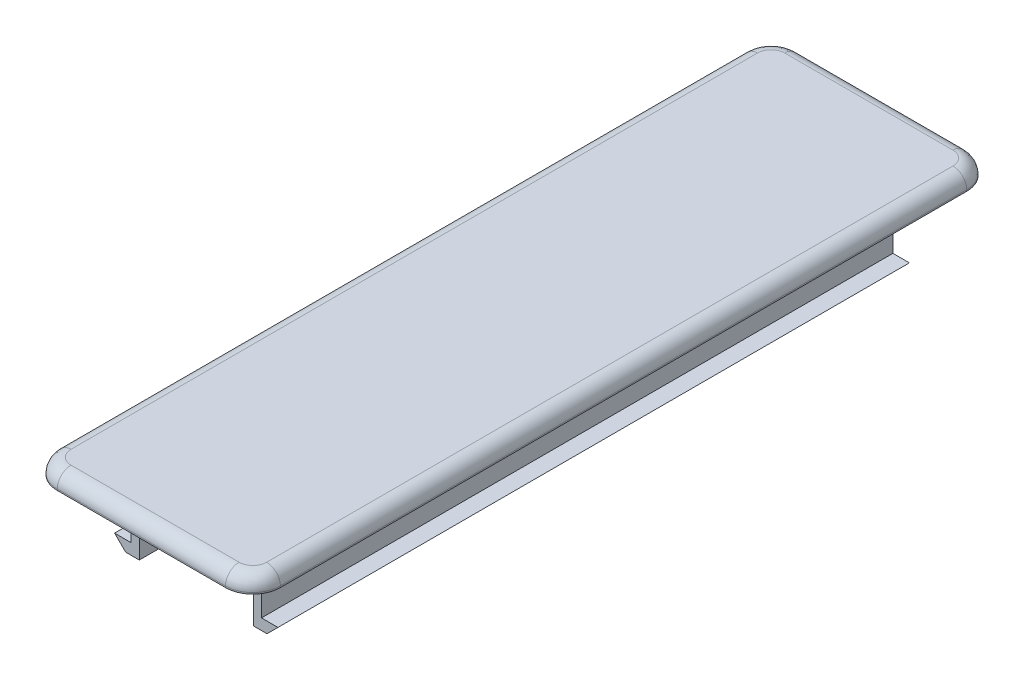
ISO-10303-21;
HEADER;
FILE_DESCRIPTION(('STEP AP214'),'2;1');
FILE_NAME('part.step','',(''),(''),'','','');
FILE_SCHEMA(('AUTOMOTIVE_DESIGN { 1 0 10303 214 1 1 1 1 }'));
ENDSEC;
DATA;
#1=APPLICATION_CONTEXT('core data for automotive mechanical design processes');
#2=APPLICATION_PROTOCOL_DEFINITION('international standard','automotive_design',2000,#1);
#3=PRODUCT_CONTEXT('',#1,'mechanical');
#4=PRODUCT('Part','Part','',(#3));
#5=PRODUCT_RELATED_PRODUCT_CATEGORY('part','',(#4));
#6=PRODUCT_DEFINITION_FORMATION('','',#4);
#7=PRODUCT_DEFINITION_CONTEXT('part definition',#1,'design');
#8=PRODUCT_DEFINITION('design','',#6,#7);
#9=PRODUCT_DEFINITION_SHAPE('','',#8);
#10=(LENGTH_UNIT() NAMED_UNIT(*) SI_UNIT(.MILLI.,.METRE.));
#11=(NAMED_UNIT(*) PLANE_ANGLE_UNIT() SI_UNIT($,.RADIAN.));
#12=(NAMED_UNIT(*) SI_UNIT($,.STERADIAN.) SOLID_ANGLE_UNIT());
#13=UNCERTAINTY_MEASURE_WITH_UNIT(LENGTH_MEASURE(1.E-05),#10,'distance_accuracy_value','');
#14=(GEOMETRIC_REPRESENTATION_CONTEXT(3) GLOBAL_UNCERTAINTY_ASSIGNED_CONTEXT((#13)) GLOBAL_UNIT_ASSIGNED_CONTEXT((#10,
#11,#12)) REPRESENTATION_CONTEXT('',''));
#15=CARTESIAN_POINT('',(0.,0.,0.));
#16=DIRECTION('',(0.,0.,1.));
#17=DIRECTION('',(1.,0.,0.));
#18=AXIS2_PLACEMENT_3D('',#15,#16,#17);
#19=CARTESIAN_POINT('',(-8.125,1.1,0.));
#20=DIRECTION('',(0.,1.,0.));
#21=DIRECTION('',(0.,0.,1.));
#22=AXIS2_PLACEMENT_3D('',#19,#20,#21);
#23=PLANE('',#22);
#24=DIRECTION('',(0.,0.,-1.));
#25=VECTOR('',#24,1.);
#26=CARTESIAN_POINT('',(7.125,1.1,0.));
#27=LINE('',#26,#25);
#28=CARTESIAN_POINT('',(7.125,1.1,-25.));
#29=VERTEX_POINT('',#28);
#30=CARTESIAN_POINT('',(7.125,1.1,25.));
#31=VERTEX_POINT('',#30);
#32=EDGE_CURVE('E428',#29,#31,#27,.F.);
#33=ORIENTED_EDGE('',*,*,#32,.F.);
#34=CARTESIAN_POINT('',(6.125,1.1,-25.));
#35=DIRECTION('',(0.,-1.,0.));
#36=DIRECTION('',(0.,0.,-1.));
#37=AXIS2_PLACEMENT_3D('',#34,#35,#36);
#38=CIRCLE('',#37,1.);
#39=CARTESIAN_POINT('',(6.125,1.1,-26.));
#40=VERTEX_POINT('',#39);
#41=EDGE_CURVE('E440',#40,#29,#38,.T.);
#42=ORIENTED_EDGE('',*,*,#41,.F.);
#43=DIRECTION('',(-1.,0.,0.));
#44=VECTOR('',#43,1.);
#45=CARTESIAN_POINT('',(-4.0625,1.1,-26.));
#46=LINE('',#45,#44);
#47=CARTESIAN_POINT('',(-6.125,1.1,-26.));
#48=VERTEX_POINT('',#47);
#49=EDGE_CURVE('E205',#48,#40,#46,.F.);
#50=ORIENTED_EDGE('',*,*,#49,.F.);
#51=CARTESIAN_POINT('',(-6.125,1.1,-25.));
#52=DIRECTION('',(0.,-1.,0.));
#53=DIRECTION('',(-1.,0.,0.));
#54=AXIS2_PLACEMENT_3D('',#51,#52,#53);
#55=CIRCLE('',#54,1.);
#56=CARTESIAN_POINT('',(-7.125,1.1,-25.));
#57=VERTEX_POINT('',#56);
#58=EDGE_CURVE('E327',#57,#48,#55,.T.);
#59=ORIENTED_EDGE('',*,*,#58,.F.);
#60=DIRECTION('',(0.,0.,-1.));
#61=VECTOR('',#60,1.);
#62=CARTESIAN_POINT('',(-7.125,1.1,0.));
#63=LINE('',#62,#61);
#64=CARTESIAN_POINT('',(-7.125,1.1,25.));
#65=VERTEX_POINT('',#64);
#66=EDGE_CURVE('E361',#65,#57,#63,.T.);
#67=ORIENTED_EDGE('',*,*,#66,.F.);
#68=CARTESIAN_POINT('',(-6.125,1.1,25.));
#69=DIRECTION('',(0.,-1.,0.));
#70=DIRECTION('',(0.,0.,1.));
#71=AXIS2_PLACEMENT_3D('',#68,#69,#70);
#72=CIRCLE('',#71,1.);
#73=CARTESIAN_POINT('',(-6.125,1.1,26.));
#74=VERTEX_POINT('',#73);
#75=EDGE_CURVE('E375',#74,#65,#72,.T.);
#76=ORIENTED_EDGE('',*,*,#75,.F.);
#77=DIRECTION('',(1.,0.,0.));
#78=VECTOR('',#77,1.);
#79=CARTESIAN_POINT('',(-4.0625,1.1,26.));
#80=LINE('',#79,#78);
#81=CARTESIAN_POINT('',(6.125,1.1,26.));
#82=VERTEX_POINT('',#81);
#83=EDGE_CURVE('E380',#82,#74,#80,.F.);
#84=ORIENTED_EDGE('',*,*,#83,.F.);
#85=CARTESIAN_POINT('',(6.125,1.1,25.));
#86=DIRECTION('',(0.,-1.,0.));
#87=DIRECTION('',(1.,0.,0.));
#88=AXIS2_PLACEMENT_3D('',#85,#86,#87);
#89=CIRCLE('',#88,1.);
#90=EDGE_CURVE('E407',#31,#82,#89,.T.);
#91=ORIENTED_EDGE('',*,*,#90,.F.);
#92=EDGE_LOOP('',(#33,#42,#50,#59,#67,#76,#84,#91));
#93=FACE_BOUND('',#92,.T.);
#94=ADVANCED_FACE('F15',(#93),#23,.T.);
#95=CARTESIAN_POINT('',(-5.15,-5.4,0.));
#96=DIRECTION('',(-0.707106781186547,-0.707106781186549,0.));
#97=DIRECTION('',(0.707106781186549,-0.707106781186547,0.));
#98=AXIS2_PLACEMENT_3D('',#95,#96,#97);
#99=PLANE('',#98);
#100=DIRECTION('',(0.707106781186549,-0.707106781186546,0.));
#101=VECTOR('',#100,1.);
#102=CARTESIAN_POINT('',(-5.95,-4.6,23.));
#103=LINE('',#102,#101);
#104=CARTESIAN_POINT('',(-5.95,-4.6,23.));
#105=VERTEX_POINT('',#104);
#106=CARTESIAN_POINT('',(-5.15,-5.4,23.));
#107=VERTEX_POINT('',#106);
#108=EDGE_CURVE('E194',#105,#107,#103,.T.);
#109=ORIENTED_EDGE('',*,*,#108,.F.);
#110=DIRECTION('',(0.,0.,1.));
#111=VECTOR('',#110,1.);
#112=CARTESIAN_POINT('',(-5.95,-4.6,0.));
#113=LINE('',#112,#111);
#114=CARTESIAN_POINT('',(-5.95,-4.6,-23.));
#115=VERTEX_POINT('',#114);
#116=EDGE_CURVE('E180',#115,#105,#113,.T.);
#117=ORIENTED_EDGE('',*,*,#116,.F.);
#118=DIRECTION('',(-0.707106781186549,0.707106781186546,0.));
#119=VECTOR('',#118,1.);
#120=CARTESIAN_POINT('',(-5.15,-5.4,-23.));
#121=LINE('',#120,#119);
#122=CARTESIAN_POINT('',(-5.15,-5.4,-23.));
#123=VERTEX_POINT('',#122);
#124=EDGE_CURVE('E19',#123,#115,#121,.T.);
#125=ORIENTED_EDGE('',*,*,#124,.F.);
#126=DIRECTION('',(0.,0.,-1.));
#127=VECTOR('',#126,1.);
#128=CARTESIAN_POINT('',(-5.15,-5.4,0.));
#129=LINE('',#128,#127);
#130=EDGE_CURVE('E178',#107,#123,#129,.T.);
#131=ORIENTED_EDGE('',*,*,#130,.F.);
#132=EDGE_LOOP('',(#109,#117,#125,#131));
#133=FACE_BOUND('',#132,.T.);
#134=ADVANCED_FACE('F176',(#133),#99,.T.);
#135=CARTESIAN_POINT('',(5.95,-4.6,0.));
#136=DIRECTION('',(0.707106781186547,-0.707106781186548,0.));
#137=DIRECTION('',(0.707106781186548,0.707106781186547,0.));
#138=AXIS2_PLACEMENT_3D('',#135,#136,#137);
#139=PLANE('',#138);
#140=DIRECTION('',(0.707106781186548,0.707106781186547,0.));
#141=VECTOR('',#140,1.);
#142=CARTESIAN_POINT('',(5.15,-5.4,23.));
#143=LINE('',#142,#141);
#144=CARTESIAN_POINT('',(5.15,-5.4,23.));
#145=VERTEX_POINT('',#144);
#146=CARTESIAN_POINT('',(5.95,-4.6,23.));
#147=VERTEX_POINT('',#146);
#148=EDGE_CURVE('E212',#145,#147,#143,.T.);
#149=ORIENTED_EDGE('',*,*,#148,.F.);
#150=DIRECTION('',(0.,0.,-1.));
#151=VECTOR('',#150,1.);
#152=CARTESIAN_POINT('',(5.15,-5.4,0.));
#153=LINE('',#152,#151);
#154=CARTESIAN_POINT('',(5.15,-5.4,-23.));
#155=VERTEX_POINT('',#154);
#156=EDGE_CURVE('E197',#155,#145,#153,.F.);
#157=ORIENTED_EDGE('',*,*,#156,.F.);
#158=DIRECTION('',(-0.707106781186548,-0.707106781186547,0.));
#159=VECTOR('',#158,1.);
#160=CARTESIAN_POINT('',(5.95,-4.6,-23.));
#161=LINE('',#160,#159);
#162=CARTESIAN_POINT('',(5.95,-4.6,-23.));
#163=VERTEX_POINT('',#162);
#164=EDGE_CURVE('E199',#163,#155,#161,.T.);
#165=ORIENTED_EDGE('',*,*,#164,.F.);
#166=DIRECTION('',(0.,0.,1.));
#167=VECTOR('',#166,1.);
#168=CARTESIAN_POINT('',(5.95,-4.6,0.));
#169=LINE('',#168,#167);
#170=EDGE_CURVE('E213',#147,#163,#169,.F.);
#171=ORIENTED_EDGE('',*,*,#170,.F.);
#172=EDGE_LOOP('',(#149,#157,#165,#171));
#173=FACE_BOUND('',#172,.T.);
#174=ADVANCED_FACE('F245',(#173),#139,.T.);
#175=CARTESIAN_POINT('',(6.125,0.1,-26.));
#176=DIRECTION('',(1.,0.,0.));
#177=DIRECTION('',(0.,0.,-1.));
#178=AXIS2_PLACEMENT_3D('',#175,#176,#177);
#179=CIRCLE('',#178,1.);
#180=TRIMMED_CURVE('',#179,(PARAMETER_VALUE(-3.14159265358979)),
(PARAMETER_VALUE(3.14159265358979)),.T.,.PARAMETER.);
#181=CARTESIAN_POINT('',(6.125,0.1,-25.));
#182=DIRECTION('',(0.,-1.,0.));
#183=AXIS1_PLACEMENT('',#181,#182);
#184=SURFACE_OF_REVOLUTION('',#180,#183);
#185=CARTESIAN_POINT('',(6.125,0.100000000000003,-26.));
#186=DIRECTION('',(-1.,0.,0.));
#187=DIRECTION('',(0.,-1.,0.));
#188=AXIS2_PLACEMENT_3D('',#185,#186,#187);
#189=CIRCLE('',#188,1.);
#190=CARTESIAN_POINT('',(6.125,0.100000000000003,-27.));
#191=VERTEX_POINT('',#190);
#192=EDGE_CURVE('E323',#40,#191,#189,.T.);
#193=ORIENTED_EDGE('',*,*,#192,.F.);
#194=ORIENTED_EDGE('',*,*,#41,.T.);
#195=CARTESIAN_POINT('',(7.125,0.100000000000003,-25.));
#196=DIRECTION('',(0.,0.,-1.));
#197=DIRECTION('',(-1.,0.,0.));
#198=AXIS2_PLACEMENT_3D('',#195,#196,#197);
#199=CIRCLE('',#198,1.);
#200=CARTESIAN_POINT('',(8.125,0.100000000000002,-25.));
#201=VERTEX_POINT('',#200);
#202=EDGE_CURVE('E435',#201,#29,#199,.F.);
#203=ORIENTED_EDGE('',*,*,#202,.F.);
#204=CARTESIAN_POINT('',(6.125,0.100000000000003,-25.));
#205=DIRECTION('',(0.,1.,0.));
#206=DIRECTION('',(0.,0.,1.));
#207=AXIS2_PLACEMENT_3D('',#204,#205,#206);
#208=CIRCLE('',#207,2.);
#209=EDGE_CURVE('E215',#191,#201,#208,.F.);
#210=ORIENTED_EDGE('',*,*,#209,.F.);
#211=EDGE_LOOP('',(#193,#194,#203,#210));
#212=FACE_BOUND('',#211,.T.);
#213=ADVANCED_FACE('F444',(#212),#184,.F.);
#214=CARTESIAN_POINT('',(7.125,0.100000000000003,0.));
#215=DIRECTION('',(0.,0.,-1.));
#216=DIRECTION('',(-1.,0.,0.));
#217=AXIS2_PLACEMENT_3D('',#214,#215,#216);
#218=CYLINDRICAL_SURFACE('',#217,1.);
#219=ORIENTED_EDGE('',*,*,#202,.T.);
#220=ORIENTED_EDGE('',*,*,#32,.T.);
#221=CARTESIAN_POINT('',(7.125,0.1,25.));
#222=DIRECTION('',(0.,0.,1.));
#223=DIRECTION('',(1.,0.,0.));
#224=AXIS2_PLACEMENT_3D('',#221,#222,#223);
#225=CIRCLE('',#224,1.);
#226=CARTESIAN_POINT('',(8.125,0.100000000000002,25.));
#227=VERTEX_POINT('',#226);
#228=EDGE_CURVE('E414',#227,#31,#225,.T.);
#229=ORIENTED_EDGE('',*,*,#228,.F.);
#230=DIRECTION('',(0.,0.,-1.));
#231=VECTOR('',#230,1.);
#232=CARTESIAN_POINT('',(8.125,0.1,0.));
#233=LINE('',#232,#231);
#234=EDGE_CURVE('E309',#201,#227,#233,.F.);
#235=ORIENTED_EDGE('',*,*,#234,.F.);
#236=EDGE_LOOP('',(#219,#220,#229,#235));
#237=FACE_BOUND('',#236,.T.);
#238=ADVANCED_FACE('F420',(#237),#218,.T.);
#239=CARTESIAN_POINT('',(6.125,0.1,24.));
#240=DIRECTION('',(1.,0.,0.));
#241=DIRECTION('',(0.,0.,-1.));
#242=AXIS2_PLACEMENT_3D('',#239,#240,#241);
#243=CIRCLE('',#242,1.);
#244=TRIMMED_CURVE('',#243,(PARAMETER_VALUE(-3.14159265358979)),
(PARAMETER_VALUE(3.14159265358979)),.T.,.PARAMETER.);
#245=CARTESIAN_POINT('',(6.125,0.1,25.));
#246=DIRECTION('',(0.,-1.,0.));
#247=AXIS1_PLACEMENT('',#245,#246);
#248=SURFACE_OF_REVOLUTION('',#244,#247);
#249=ORIENTED_EDGE('',*,*,#228,.T.);
#250=ORIENTED_EDGE('',*,*,#90,.T.);
#251=CARTESIAN_POINT('',(6.125,0.100000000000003,26.));
#252=DIRECTION('',(1.,0.,0.));
#253=DIRECTION('',(0.,1.,0.));
#254=AXIS2_PLACEMENT_3D('',#251,#252,#253);
#255=CIRCLE('',#254,1.);
#256=CARTESIAN_POINT('',(6.125,0.100000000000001,27.));
#257=VERTEX_POINT('',#256);
#258=EDGE_CURVE('E404',#257,#82,#255,.F.);
#259=ORIENTED_EDGE('',*,*,#258,.F.);
#260=CARTESIAN_POINT('',(6.125,0.100000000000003,25.));
#261=DIRECTION('',(0.,-1.,0.));
#262=DIRECTION('',(0.,0.,-1.));
#263=AXIS2_PLACEMENT_3D('',#260,#261,#262);
#264=CIRCLE('',#263,2.);
#265=EDGE_CURVE('E305',#227,#257,#264,.T.);
#266=ORIENTED_EDGE('',*,*,#265,.F.);
#267=EDGE_LOOP('',(#249,#250,#259,#266));
#268=FACE_BOUND('',#267,.T.);
#269=ADVANCED_FACE('F416',(#268),#248,.F.);
#270=CARTESIAN_POINT('',(-4.0625,0.100000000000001,26.));
#271=DIRECTION('',(1.,0.,0.));
#272=DIRECTION('',(0.,1.,0.));
#273=AXIS2_PLACEMENT_3D('',#270,#271,#272);
#274=CYLINDRICAL_SURFACE('',#273,1.);
#275=CARTESIAN_POINT('',(-6.125,0.1,26.));
#276=DIRECTION('',(-1.,0.,0.));
#277=DIRECTION('',(0.,0.,1.));
#278=AXIS2_PLACEMENT_3D('',#275,#276,#277);
#279=CIRCLE('',#278,1.);
#280=CARTESIAN_POINT('',(-6.125,0.1,27.));
#281=VERTEX_POINT('',#280);
#282=EDGE_CURVE('E398',#281,#74,#279,.T.);
#283=ORIENTED_EDGE('',*,*,#282,.F.);
#284=DIRECTION('',(1.,0.,0.));
#285=VECTOR('',#284,1.);
#286=CARTESIAN_POINT('',(0.,0.1,27.));
#287=LINE('',#286,#285);
#288=EDGE_CURVE('E301',#257,#281,#287,.F.);
#289=ORIENTED_EDGE('',*,*,#288,.F.);
#290=ORIENTED_EDGE('',*,*,#258,.T.);
#291=ORIENTED_EDGE('',*,*,#83,.T.);
#292=EDGE_LOOP('',(#283,#289,#290,#291));
#293=FACE_BOUND('',#292,.T.);
#294=ADVANCED_FACE('F392',(#293),#274,.T.);
#295=CARTESIAN_POINT('',(-6.125,0.1,24.));
#296=DIRECTION('',(1.,0.,0.));
#297=DIRECTION('',(0.,0.,-1.));
#298=AXIS2_PLACEMENT_3D('',#295,#296,#297);
#299=CIRCLE('',#298,1.);
#300=TRIMMED_CURVE('',#299,(PARAMETER_VALUE(-3.14159265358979)),
(PARAMETER_VALUE(3.14159265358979)),.T.,.PARAMETER.);
#301=CARTESIAN_POINT('',(-6.125,0.1,25.));
#302=DIRECTION('',(0.,-1.,0.));
#303=AXIS1_PLACEMENT('',#301,#302);
#304=SURFACE_OF_REVOLUTION('',#300,#303);
#305=CARTESIAN_POINT('',(-7.125,0.1,25.));
#306=DIRECTION('',(0.,0.,-1.));
#307=DIRECTION('',(-1.,0.,0.));
#308=AXIS2_PLACEMENT_3D('',#305,#306,#307);
#309=CIRCLE('',#308,1.);
#310=CARTESIAN_POINT('',(-8.125,0.1,25.));
#311=VERTEX_POINT('',#310);
#312=EDGE_CURVE('E368',#311,#65,#309,.T.);
#313=ORIENTED_EDGE('',*,*,#312,.F.);
#314=CARTESIAN_POINT('',(-6.125,0.1,25.));
#315=DIRECTION('',(0.,1.,0.));
#316=DIRECTION('',(0.,0.,1.));
#317=AXIS2_PLACEMENT_3D('',#314,#315,#316);
#318=CIRCLE('',#317,2.);
#319=EDGE_CURVE('E297',#281,#311,#318,.F.);
#320=ORIENTED_EDGE('',*,*,#319,.F.);
#321=ORIENTED_EDGE('',*,*,#282,.T.);
#322=ORIENTED_EDGE('',*,*,#75,.T.);
#323=EDGE_LOOP('',(#313,#320,#321,#322));
#324=FACE_BOUND('',#323,.T.);
#325=ADVANCED_FACE('F382',(#324),#304,.F.);
#326=CARTESIAN_POINT('',(-7.125,0.1,0.));
#327=DIRECTION('',(0.,0.,-1.));
#328=DIRECTION('',(-1.,0.,0.));
#329=AXIS2_PLACEMENT_3D('',#326,#327,#328);
#330=CYLINDRICAL_SURFACE('',#329,1.);
#331=CARTESIAN_POINT('',(-7.125,0.0999999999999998,-25.));
#332=DIRECTION('',(0.,0.,-1.));
#333=DIRECTION('',(-1.,0.,0.));
#334=AXIS2_PLACEMENT_3D('',#331,#332,#333);
#335=CIRCLE('',#334,1.);
#336=CARTESIAN_POINT('',(-8.125,0.1,-25.));
#337=VERTEX_POINT('',#336);
#338=EDGE_CURVE('E342',#337,#57,#335,.T.);
#339=ORIENTED_EDGE('',*,*,#338,.F.);
#340=DIRECTION('',(0.,0.,1.));
#341=VECTOR('',#340,1.);
#342=CARTESIAN_POINT('',(-8.125,0.1,0.));
#343=LINE('',#342,#341);
#344=EDGE_CURVE('E293',#311,#337,#343,.F.);
#345=ORIENTED_EDGE('',*,*,#344,.F.);
#346=ORIENTED_EDGE('',*,*,#312,.T.);
#347=ORIENTED_EDGE('',*,*,#66,.T.);
#348=EDGE_LOOP('',(#339,#345,#346,#347));
#349=FACE_BOUND('',#348,.T.);
#350=ADVANCED_FACE('F351',(#349),#330,.T.);
#351=CARTESIAN_POINT('',(-6.125,0.1,-26.));
#352=DIRECTION('',(1.,0.,0.));
#353=DIRECTION('',(0.,0.,-1.));
#354=AXIS2_PLACEMENT_3D('',#351,#352,#353);
#355=CIRCLE('',#354,1.);
#356=TRIMMED_CURVE('',#355,(PARAMETER_VALUE(-3.14159265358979)),
(PARAMETER_VALUE(3.14159265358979)),.T.,.PARAMETER.);
#357=CARTESIAN_POINT('',(-6.125,0.1,-25.));
#358=DIRECTION('',(0.,-1.,0.));
#359=AXIS1_PLACEMENT('',#357,#358);
#360=SURFACE_OF_REVOLUTION('',#356,#359);
#361=CARTESIAN_POINT('',(-6.125,0.100000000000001,-26.));
#362=DIRECTION('',(-1.,0.,0.));
#363=DIRECTION('',(0.,-1.,0.));
#364=AXIS2_PLACEMENT_3D('',#361,#362,#363);
#365=CIRCLE('',#364,1.);
#366=CARTESIAN_POINT('',(-6.125,0.100000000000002,-27.));
#367=VERTEX_POINT('',#366);
#368=EDGE_CURVE('E326',#367,#48,#365,.F.);
#369=ORIENTED_EDGE('',*,*,#368,.F.);
#370=CARTESIAN_POINT('',(-6.125,0.1,-25.));
#371=DIRECTION('',(0.,-1.,0.));
#372=DIRECTION('',(0.,0.,-1.));
#373=AXIS2_PLACEMENT_3D('',#370,#371,#372);
#374=CIRCLE('',#373,2.);
#375=EDGE_CURVE('E289',#337,#367,#374,.T.);
#376=ORIENTED_EDGE('',*,*,#375,.F.);
#377=ORIENTED_EDGE('',*,*,#338,.T.);
#378=ORIENTED_EDGE('',*,*,#58,.T.);
#379=EDGE_LOOP('',(#369,#376,#377,#378));
#380=FACE_BOUND('',#379,.T.);
#381=ADVANCED_FACE('F345',(#380),#360,.F.);
#382=CARTESIAN_POINT('',(-4.0625,0.100000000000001,-26.));
#383=DIRECTION('',(-1.,0.,0.));
#384=DIRECTION('',(0.,-1.,0.));
#385=AXIS2_PLACEMENT_3D('',#382,#383,#384);
#386=CYLINDRICAL_SURFACE('',#385,1.);
#387=ORIENTED_EDGE('',*,*,#368,.T.);
#388=ORIENTED_EDGE('',*,*,#49,.T.);
#389=ORIENTED_EDGE('',*,*,#192,.T.);
#390=DIRECTION('',(1.,0.,0.));
#391=VECTOR('',#390,1.);
#392=CARTESIAN_POINT('',(0.,0.100000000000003,-27.));
#393=LINE('',#392,#391);
#394=EDGE_CURVE('E280',#191,#367,#393,.F.);
#395=ORIENTED_EDGE('',*,*,#394,.T.);
#396=EDGE_LOOP('',(#387,#388,#389,#395));
#397=FACE_BOUND('',#396,.T.);
#398=ADVANCED_FACE('F350',(#397),#386,.T.);
#399=CARTESIAN_POINT('',(-5.95,-4.6,0.));
#400=DIRECTION('',(0.,1.,0.));
#401=DIRECTION('',(0.,0.,1.));
#402=AXIS2_PLACEMENT_3D('',#399,#400,#401);
#403=PLANE('',#402);
#404=DIRECTION('',(1.,0.,0.));
#405=VECTOR('',#404,1.);
#406=CARTESIAN_POINT('',(1.40627206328,-4.6,23.));
#407=LINE('',#406,#405);
#408=CARTESIAN_POINT('',(-4.75,-4.6,23.));
#409=VERTEX_POINT('',#408);
#410=EDGE_CURVE('E316',#409,#105,#407,.F.);
#411=ORIENTED_EDGE('',*,*,#410,.F.);
#412=DIRECTION('',(0.,0.,1.));
#413=VECTOR('',#412,1.);
#414=CARTESIAN_POINT('',(-4.75,-4.6,0.));
#415=LINE('',#414,#413);
#416=CARTESIAN_POINT('',(-4.75,-4.6,-23.));
#417=VERTEX_POINT('',#416);
#418=EDGE_CURVE('E274',#417,#409,#415,.T.);
#419=ORIENTED_EDGE('',*,*,#418,.F.);
#420=DIRECTION('',(1.,0.,0.));
#421=VECTOR('',#420,1.);
#422=CARTESIAN_POINT('',(-5.05,-4.6,-23.));
#423=LINE('',#422,#421);
#424=EDGE_CURVE('E183',#115,#417,#423,.T.);
#425=ORIENTED_EDGE('',*,*,#424,.F.);
#426=ORIENTED_EDGE('',*,*,#116,.T.);
#427=EDGE_LOOP('',(#411,#419,#425,#426));
#428=FACE_BOUND('',#427,.T.);
#429=ADVANCED_FACE('F587',(#428),#403,.T.);
#430=CARTESIAN_POINT('',(-5.95,0.,-23.));
#431=DIRECTION('',(0.,0.,-1.));
#432=DIRECTION('',(1.,0.,0.));
#433=AXIS2_PLACEMENT_3D('',#430,#431,#432);
#434=PLANE('',#433);
#435=ORIENTED_EDGE('',*,*,#124,.T.);
#436=ORIENTED_EDGE('',*,*,#424,.T.);
#437=DIRECTION('',(0.,1.,0.));
#438=VECTOR('',#437,1.);
#439=CARTESIAN_POINT('',(-4.75,-4.6,-23.));
#440=LINE('',#439,#438);
#441=CARTESIAN_POINT('',(-4.75,0.,-23.));
#442=VERTEX_POINT('',#441);
#443=EDGE_CURVE('E277',#442,#417,#440,.F.);
#444=ORIENTED_EDGE('',*,*,#443,.F.);
#445=DIRECTION('',(1.,0.,0.));
#446=VECTOR('',#445,1.);
#447=CARTESIAN_POINT('',(-5.05,0.,-23.));
#448=LINE('',#447,#446);
#449=CARTESIAN_POINT('',(-4.15,0.,-23.));
#450=VERTEX_POINT('',#449);
#451=EDGE_CURVE('E184',#442,#450,#448,.T.);
#452=ORIENTED_EDGE('',*,*,#451,.T.);
#453=DIRECTION('',(0.,1.,0.));
#454=VECTOR('',#453,1.);
#455=CARTESIAN_POINT('',(-4.15,0.,-23.));
#456=LINE('',#455,#454);
#457=CARTESIAN_POINT('',(-4.15,-5.4,-23.));
#458=VERTEX_POINT('',#457);
#459=EDGE_CURVE('E189',#458,#450,#456,.T.);
#460=ORIENTED_EDGE('',*,*,#459,.F.);
#461=DIRECTION('',(1.,0.,0.));
#462=VECTOR('',#461,1.);
#463=CARTESIAN_POINT('',(-4.15,-5.4,-23.));
#464=LINE('',#463,#462);
#465=EDGE_CURVE('E186',#123,#458,#464,.T.);
#466=ORIENTED_EDGE('',*,*,#465,.F.);
#467=EDGE_LOOP('',(#435,#436,#444,#452,#460,#466));
#468=FACE_BOUND('',#467,.T.);
#469=ADVANCED_FACE('F187',(#468),#434,.T.);
#470=CARTESIAN_POINT('',(1.40627206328,-5.96476942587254,23.));
#471=DIRECTION('',(0.,0.,1.));
#472=DIRECTION('',(1.,0.,0.));
#473=AXIS2_PLACEMENT_3D('',#470,#471,#472);
#474=PLANE('',#473);
#475=ORIENTED_EDGE('',*,*,#108,.T.);
#476=DIRECTION('',(1.,0.,0.));
#477=VECTOR('',#476,1.);
#478=CARTESIAN_POINT('',(-4.15,-5.4,23.));
#479=LINE('',#478,#477);
#480=CARTESIAN_POINT('',(-4.15,-5.4,23.));
#481=VERTEX_POINT('',#480);
#482=EDGE_CURVE('E193',#481,#107,#479,.F.);
#483=ORIENTED_EDGE('',*,*,#482,.F.);
#484=DIRECTION('',(0.,1.,0.));
#485=VECTOR('',#484,1.);
#486=CARTESIAN_POINT('',(-4.15,0.,23.));
#487=LINE('',#486,#485);
#488=CARTESIAN_POINT('',(-4.15,0.,23.));
#489=VERTEX_POINT('',#488);
#490=EDGE_CURVE('E264',#489,#481,#487,.F.);
#491=ORIENTED_EDGE('',*,*,#490,.F.);
#492=DIRECTION('',(1.,0.,0.));
#493=VECTOR('',#492,1.);
#494=CARTESIAN_POINT('',(1.40627206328,0.,23.));
#495=LINE('',#494,#493);
#496=CARTESIAN_POINT('',(-4.75,0.,23.));
#497=VERTEX_POINT('',#496);
#498=EDGE_CURVE('E207',#489,#497,#495,.F.);
#499=ORIENTED_EDGE('',*,*,#498,.T.);
#500=DIRECTION('',(0.,1.,0.));
#501=VECTOR('',#500,1.);
#502=CARTESIAN_POINT('',(-4.75,-4.6,23.));
#503=LINE('',#502,#501);
#504=EDGE_CURVE('E271',#409,#497,#503,.T.);
#505=ORIENTED_EDGE('',*,*,#504,.F.);
#506=ORIENTED_EDGE('',*,*,#410,.T.);
#507=EDGE_LOOP('',(#475,#483,#491,#499,#505,#506));
#508=FACE_BOUND('',#507,.T.);
#509=ADVANCED_FACE('F583',(#508),#474,.T.);
#510=CARTESIAN_POINT('',(-4.15,-5.4,0.));
#511=DIRECTION('',(0.,-1.,0.));
#512=DIRECTION('',(0.,0.,-1.));
#513=AXIS2_PLACEMENT_3D('',#510,#511,#512);
#514=PLANE('',#513);
#515=ORIENTED_EDGE('',*,*,#482,.T.);
#516=ORIENTED_EDGE('',*,*,#130,.T.);
#517=ORIENTED_EDGE('',*,*,#465,.T.);
#518=DIRECTION('',(0.,0.,-1.));
#519=VECTOR('',#518,1.);
#520=CARTESIAN_POINT('',(-4.15,-5.4,0.));
#521=LINE('',#520,#519);
#522=EDGE_CURVE('E262',#481,#458,#521,.T.);
#523=ORIENTED_EDGE('',*,*,#522,.F.);
#524=EDGE_LOOP('',(#515,#516,#517,#523));
#525=FACE_BOUND('',#524,.T.);
#526=ADVANCED_FACE('F196',(#525),#514,.T.);
#527=CARTESIAN_POINT('',(5.15,-5.4,0.));
#528=DIRECTION('',(0.,-1.,0.));
#529=DIRECTION('',(0.,0.,-1.));
#530=AXIS2_PLACEMENT_3D('',#527,#528,#529);
#531=PLANE('',#530);
#532=DIRECTION('',(1.,0.,0.));
#533=VECTOR('',#532,1.);
#534=CARTESIAN_POINT('',(1.40627206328,-5.4,23.));
#535=LINE('',#534,#533);
#536=CARTESIAN_POINT('',(4.15,-5.4,23.));
#537=VERTEX_POINT('',#536);
#538=EDGE_CURVE('E253',#537,#145,#535,.T.);
#539=ORIENTED_EDGE('',*,*,#538,.F.);
#540=DIRECTION('',(0.,0.,1.));
#541=VECTOR('',#540,1.);
#542=CARTESIAN_POINT('',(4.15,-5.4,0.));
#543=LINE('',#542,#541);
#544=CARTESIAN_POINT('',(4.15,-5.4,-23.));
#545=VERTEX_POINT('',#544);
#546=EDGE_CURVE('E251',#545,#537,#543,.T.);
#547=ORIENTED_EDGE('',*,*,#546,.F.);
#548=DIRECTION('',(-1.,0.,0.));
#549=VECTOR('',#548,1.);
#550=CARTESIAN_POINT('',(5.05,-5.4,-23.));
#551=LINE('',#550,#549);
#552=EDGE_CURVE('E217',#155,#545,#551,.T.);
#553=ORIENTED_EDGE('',*,*,#552,.F.);
#554=ORIENTED_EDGE('',*,*,#156,.T.);
#555=EDGE_LOOP('',(#539,#547,#553,#554));
#556=FACE_BOUND('',#555,.T.);
#557=ADVANCED_FACE('F249',(#556),#531,.T.);
#558=CARTESIAN_POINT('',(4.15,0.,-23.));
#559=DIRECTION('',(0.,0.,-1.));
#560=DIRECTION('',(1.,0.,0.));
#561=AXIS2_PLACEMENT_3D('',#558,#559,#560);
#562=PLANE('',#561);
#563=DIRECTION('',(0.,1.,0.));
#564=VECTOR('',#563,1.);
#565=CARTESIAN_POINT('',(4.15,-5.4,-23.));
#566=LINE('',#565,#564);
#567=CARTESIAN_POINT('',(4.15,0.,-23.));
#568=VERTEX_POINT('',#567);
#569=EDGE_CURVE('E258',#568,#545,#566,.F.);
#570=ORIENTED_EDGE('',*,*,#569,.F.);
#571=DIRECTION('',(1.,0.,0.));
#572=VECTOR('',#571,1.);
#573=CARTESIAN_POINT('',(5.05,0.,-23.));
#574=LINE('',#573,#572);
#575=CARTESIAN_POINT('',(4.75,0.,-23.));
#576=VERTEX_POINT('',#575);
#577=EDGE_CURVE('E219',#568,#576,#574,.T.);
#578=ORIENTED_EDGE('',*,*,#577,.T.);
#579=DIRECTION('',(0.,1.,0.));
#580=VECTOR('',#579,1.);
#581=CARTESIAN_POINT('',(4.75,0.,-23.));
#582=LINE('',#581,#580);
#583=CARTESIAN_POINT('',(4.75,-4.6,-23.));
#584=VERTEX_POINT('',#583);
#585=EDGE_CURVE('E571',#584,#576,#582,.T.);
#586=ORIENTED_EDGE('',*,*,#585,.F.);
#587=DIRECTION('',(1.,0.,0.));
#588=VECTOR('',#587,1.);
#589=CARTESIAN_POINT('',(4.75,-4.6,-23.));
#590=LINE('',#589,#588);
#591=EDGE_CURVE('E208',#163,#584,#590,.F.);
#592=ORIENTED_EDGE('',*,*,#591,.F.);
#593=ORIENTED_EDGE('',*,*,#164,.T.);
#594=ORIENTED_EDGE('',*,*,#552,.T.);
#595=EDGE_LOOP('',(#570,#578,#586,#592,#593,#594));
#596=FACE_BOUND('',#595,.T.);
#597=ADVANCED_FACE('F17',(#596),#562,.T.);
#598=CARTESIAN_POINT('',(1.40627206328,-5.96476942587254,23.));
#599=DIRECTION('',(0.,0.,1.));
#600=DIRECTION('',(1.,0.,0.));
#601=AXIS2_PLACEMENT_3D('',#598,#599,#600);
#602=PLANE('',#601);
#603=ORIENTED_EDGE('',*,*,#148,.T.);
#604=DIRECTION('',(1.,0.,0.));
#605=VECTOR('',#604,1.);
#606=CARTESIAN_POINT('',(4.75,-4.6,23.));
#607=LINE('',#606,#605);
#608=CARTESIAN_POINT('',(4.75,-4.6,23.));
#609=VERTEX_POINT('',#608);
#610=EDGE_CURVE('E211',#609,#147,#607,.T.);
#611=ORIENTED_EDGE('',*,*,#610,.F.);
#612=DIRECTION('',(0.,1.,0.));
#613=VECTOR('',#612,1.);
#614=CARTESIAN_POINT('',(4.75,0.,23.));
#615=LINE('',#614,#613);
#616=CARTESIAN_POINT('',(4.75,0.,23.));
#617=VERTEX_POINT('',#616);
#618=EDGE_CURVE('E568',#617,#609,#615,.F.);
#619=ORIENTED_EDGE('',*,*,#618,.F.);
#620=DIRECTION('',(1.,0.,0.));
#621=VECTOR('',#620,1.);
#622=CARTESIAN_POINT('',(1.40627206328,0.,23.));
#623=LINE('',#622,#621);
#624=CARTESIAN_POINT('',(4.15,0.,23.));
#625=VERTEX_POINT('',#624);
#626=EDGE_CURVE('E33',#617,#625,#623,.F.);
#627=ORIENTED_EDGE('',*,*,#626,.T.);
#628=DIRECTION('',(0.,1.,0.));
#629=VECTOR('',#628,1.);
#630=CARTESIAN_POINT('',(4.15,-5.4,23.));
#631=LINE('',#630,#629);
#632=EDGE_CURVE('E257',#537,#625,#631,.T.);
#633=ORIENTED_EDGE('',*,*,#632,.F.);
#634=ORIENTED_EDGE('',*,*,#538,.T.);
#635=EDGE_LOOP('',(#603,#611,#619,#627,#633,#634));
#636=FACE_BOUND('',#635,.T.);
#637=ADVANCED_FACE('F683',(#636),#602,.T.);
#638=CARTESIAN_POINT('',(4.75,-4.6,0.));
#639=DIRECTION('',(0.,1.,0.));
#640=DIRECTION('',(0.,0.,1.));
#641=AXIS2_PLACEMENT_3D('',#638,#639,#640);
#642=PLANE('',#641);
#643=ORIENTED_EDGE('',*,*,#610,.T.);
#644=ORIENTED_EDGE('',*,*,#170,.T.);
#645=ORIENTED_EDGE('',*,*,#591,.T.);
#646=DIRECTION('',(0.,0.,-1.));
#647=VECTOR('',#646,1.);
#648=CARTESIAN_POINT('',(4.75,-4.6,0.));
#649=LINE('',#648,#647);
#650=EDGE_CURVE('E235',#609,#584,#649,.T.);
#651=ORIENTED_EDGE('',*,*,#650,.F.);
#652=EDGE_LOOP('',(#643,#644,#645,#651));
#653=FACE_BOUND('',#652,.T.);
#654=ADVANCED_FACE('F676',(#653),#642,.T.);
#655=CARTESIAN_POINT('',(6.125,0.014878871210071,-25.));
#656=DIRECTION('',(0.,1.,0.));
#657=DIRECTION('',(0.,0.,1.));
#658=AXIS2_PLACEMENT_3D('',#655,#656,#657);
#659=CYLINDRICAL_SURFACE('',#658,2.);
#660=CARTESIAN_POINT('',(6.125,0.,-25.));
#661=DIRECTION('',(0.,1.,0.));
#662=DIRECTION('',(0.,0.,1.));
#663=AXIS2_PLACEMENT_3D('',#660,#661,#662);
#664=CIRCLE('',#663,2.);
#665=CARTESIAN_POINT('',(6.125,0.,-27.));
#666=VERTEX_POINT('',#665);
#667=CARTESIAN_POINT('',(8.125,0.,-25.));
#668=VERTEX_POINT('',#667);
#669=EDGE_CURVE('E233',#666,#668,#664,.F.);
#670=ORIENTED_EDGE('',*,*,#669,.F.);
#671=DIRECTION('',(0.,1.,0.));
#672=VECTOR('',#671,1.);
#673=CARTESIAN_POINT('',(6.125,-1.07024225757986,-27.));
#674=LINE('',#673,#672);
#675=EDGE_CURVE('E283',#666,#191,#674,.T.);
#676=ORIENTED_EDGE('',*,*,#675,.T.);
#677=ORIENTED_EDGE('',*,*,#209,.T.);
#678=DIRECTION('',(0.,1.,0.));
#679=VECTOR('',#678,1.);
#680=CARTESIAN_POINT('',(8.125,1.1,-25.));
#681=LINE('',#680,#679);
#682=EDGE_CURVE('E306',#668,#201,#681,.T.);
#683=ORIENTED_EDGE('',*,*,#682,.F.);
#684=EDGE_LOOP('',(#670,#676,#677,#683));
#685=FACE_BOUND('',#684,.T.);
#686=ADVANCED_FACE('F547',(#685),#659,.T.);
#687=CARTESIAN_POINT('',(8.125,1.1,0.));
#688=DIRECTION('',(1.,0.,0.));
#689=DIRECTION('',(0.,0.,-1.));
#690=AXIS2_PLACEMENT_3D('',#687,#688,#689);
#691=PLANE('',#690);
#692=DIRECTION('',(0.,0.,-1.));
#693=VECTOR('',#692,1.);
#694=CARTESIAN_POINT('',(8.125,0.,0.));
#695=LINE('',#694,#693);
#696=CARTESIAN_POINT('',(8.125,0.,25.));
#697=VERTEX_POINT('',#696);
#698=EDGE_CURVE('E232',#668,#697,#695,.F.);
#699=ORIENTED_EDGE('',*,*,#698,.F.);
#700=ORIENTED_EDGE('',*,*,#682,.T.);
#701=ORIENTED_EDGE('',*,*,#234,.T.);
#702=DIRECTION('',(0.,-1.,0.));
#703=VECTOR('',#702,1.);
#704=CARTESIAN_POINT('',(8.125,0.014878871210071,25.));
#705=LINE('',#704,#703);
#706=EDGE_CURVE('E302',#697,#227,#705,.F.);
#707=ORIENTED_EDGE('',*,*,#706,.F.);
#708=EDGE_LOOP('',(#699,#700,#701,#707));
#709=FACE_BOUND('',#708,.T.);
#710=ADVANCED_FACE('F544',(#709),#691,.T.);
#711=CARTESIAN_POINT('',(6.125,0.014878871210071,25.));
#712=DIRECTION('',(0.,-1.,0.));
#713=DIRECTION('',(0.,0.,-1.));
#714=AXIS2_PLACEMENT_3D('',#711,#712,#713);
#715=CYLINDRICAL_SURFACE('',#714,2.);
#716=CARTESIAN_POINT('',(6.125,0.,25.));
#717=DIRECTION('',(0.,-1.,0.));
#718=DIRECTION('',(0.,0.,-1.));
#719=AXIS2_PLACEMENT_3D('',#716,#717,#718);
#720=CIRCLE('',#719,2.);
#721=CARTESIAN_POINT('',(6.125,0.,27.));
#722=VERTEX_POINT('',#721);
#723=EDGE_CURVE('E229',#697,#722,#720,.T.);
#724=ORIENTED_EDGE('',*,*,#723,.F.);
#725=ORIENTED_EDGE('',*,*,#706,.T.);
#726=ORIENTED_EDGE('',*,*,#265,.T.);
#727=DIRECTION('',(0.,1.,0.));
#728=VECTOR('',#727,1.);
#729=CARTESIAN_POINT('',(6.125,-1.07024225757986,27.));
#730=LINE('',#729,#728);
#731=EDGE_CURVE('E298',#722,#257,#730,.T.);
#732=ORIENTED_EDGE('',*,*,#731,.F.);
#733=EDGE_LOOP('',(#724,#725,#726,#732));
#734=FACE_BOUND('',#733,.T.);
#735=ADVANCED_FACE('F540',(#734),#715,.T.);
#736=CARTESIAN_POINT('',(0.,-1.07024225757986,27.));
#737=DIRECTION('',(0.,0.,1.));
#738=DIRECTION('',(1.,0.,0.));
#739=AXIS2_PLACEMENT_3D('',#736,#737,#738);
#740=PLANE('',#739);
#741=DIRECTION('',(1.,0.,0.));
#742=VECTOR('',#741,1.);
#743=CARTESIAN_POINT('',(8.125,0.,27.));
#744=LINE('',#743,#742);
#745=CARTESIAN_POINT('',(-6.125,0.,27.));
#746=VERTEX_POINT('',#745);
#747=EDGE_CURVE('E228',#722,#746,#744,.F.);
#748=ORIENTED_EDGE('',*,*,#747,.F.);
#749=ORIENTED_EDGE('',*,*,#731,.T.);
#750=ORIENTED_EDGE('',*,*,#288,.T.);
#751=DIRECTION('',(0.,1.,0.));
#752=VECTOR('',#751,1.);
#753=CARTESIAN_POINT('',(-6.125,-0.53512112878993,27.));
#754=LINE('',#753,#752);
#755=EDGE_CURVE('E294',#746,#281,#754,.T.);
#756=ORIENTED_EDGE('',*,*,#755,.F.);
#757=EDGE_LOOP('',(#748,#749,#750,#756));
#758=FACE_BOUND('',#757,.T.);
#759=ADVANCED_FACE('F535',(#758),#740,.T.);
#760=CARTESIAN_POINT('',(-6.125,-0.53512112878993,25.));
#761=DIRECTION('',(0.,1.,0.));
#762=DIRECTION('',(0.,0.,1.));
#763=AXIS2_PLACEMENT_3D('',#760,#761,#762);
#764=CYLINDRICAL_SURFACE('',#763,2.);
#765=CARTESIAN_POINT('',(-6.125,0.,25.));
#766=DIRECTION('',(0.,1.,0.));
#767=DIRECTION('',(0.,0.,1.));
#768=AXIS2_PLACEMENT_3D('',#765,#766,#767);
#769=CIRCLE('',#768,2.);
#770=CARTESIAN_POINT('',(-8.125,0.,25.));
#771=VERTEX_POINT('',#770);
#772=EDGE_CURVE('E225',#746,#771,#769,.F.);
#773=ORIENTED_EDGE('',*,*,#772,.F.);
#774=ORIENTED_EDGE('',*,*,#755,.T.);
#775=ORIENTED_EDGE('',*,*,#319,.T.);
#776=DIRECTION('',(0.,1.,0.));
#777=VECTOR('',#776,1.);
#778=CARTESIAN_POINT('',(-8.125,0.,25.));
#779=LINE('',#778,#777);
#780=EDGE_CURVE('E290',#771,#311,#779,.T.);
#781=ORIENTED_EDGE('',*,*,#780,.F.);
#782=EDGE_LOOP('',(#773,#774,#775,#781));
#783=FACE_BOUND('',#782,.T.);
#784=ADVANCED_FACE('F526',(#783),#764,.T.);
#785=CARTESIAN_POINT('',(-8.125,0.,0.));
#786=DIRECTION('',(-1.,0.,0.));
#787=DIRECTION('',(0.,0.,1.));
#788=AXIS2_PLACEMENT_3D('',#785,#786,#787);
#789=PLANE('',#788);
#790=DIRECTION('',(0.,0.,-1.));
#791=VECTOR('',#790,1.);
#792=CARTESIAN_POINT('',(-8.125,0.,0.));
#793=LINE('',#792,#791);
#794=CARTESIAN_POINT('',(-8.125,0.,-25.));
#795=VERTEX_POINT('',#794);
#796=EDGE_CURVE('E224',#771,#795,#793,.T.);
#797=ORIENTED_EDGE('',*,*,#796,.F.);
#798=ORIENTED_EDGE('',*,*,#780,.T.);
#799=ORIENTED_EDGE('',*,*,#344,.T.);
#800=DIRECTION('',(0.,-1.,0.));
#801=VECTOR('',#800,1.);
#802=CARTESIAN_POINT('',(-8.125,-0.53512112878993,-25.));
#803=LINE('',#802,#801);
#804=EDGE_CURVE('E284',#795,#337,#803,.F.);
#805=ORIENTED_EDGE('',*,*,#804,.F.);
#806=EDGE_LOOP('',(#797,#798,#799,#805));
#807=FACE_BOUND('',#806,.T.);
#808=ADVANCED_FACE('F518',(#807),#789,.T.);
#809=CARTESIAN_POINT('',(-6.125,-0.53512112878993,-25.));
#810=DIRECTION('',(0.,-1.,0.));
#811=DIRECTION('',(0.,0.,-1.));
#812=AXIS2_PLACEMENT_3D('',#809,#810,#811);
#813=CYLINDRICAL_SURFACE('',#812,2.);
#814=CARTESIAN_POINT('',(-6.125,0.,-25.));
#815=DIRECTION('',(0.,-1.,0.));
#816=DIRECTION('',(0.,0.,-1.));
#817=AXIS2_PLACEMENT_3D('',#814,#815,#816);
#818=CIRCLE('',#817,2.);
#819=CARTESIAN_POINT('',(-6.125,0.,-27.));
#820=VERTEX_POINT('',#819);
#821=EDGE_CURVE('E220',#795,#820,#818,.T.);
#822=ORIENTED_EDGE('',*,*,#821,.F.);
#823=ORIENTED_EDGE('',*,*,#804,.T.);
#824=ORIENTED_EDGE('',*,*,#375,.T.);
#825=DIRECTION('',(0.,1.,0.));
#826=VECTOR('',#825,1.);
#827=CARTESIAN_POINT('',(-6.125,-1.07024225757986,-27.));
#828=LINE('',#827,#826);
#829=EDGE_CURVE('E281',#367,#820,#828,.F.);
#830=ORIENTED_EDGE('',*,*,#829,.T.);
#831=EDGE_LOOP('',(#822,#823,#824,#830));
#832=FACE_BOUND('',#831,.T.);
#833=ADVANCED_FACE('F513',(#832),#813,.T.);
#834=CARTESIAN_POINT('',(0.,-1.07024225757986,-27.));
#835=DIRECTION('',(0.,0.,1.));
#836=DIRECTION('',(1.,0.,0.));
#837=AXIS2_PLACEMENT_3D('',#834,#835,#836);
#838=PLANE('',#837);
#839=ORIENTED_EDGE('',*,*,#675,.F.);
#840=DIRECTION('',(1.,0.,0.));
#841=VECTOR('',#840,1.);
#842=CARTESIAN_POINT('',(8.125,0.,-27.));
#843=LINE('',#842,#841);
#844=EDGE_CURVE('E223',#820,#666,#843,.T.);
#845=ORIENTED_EDGE('',*,*,#844,.F.);
#846=ORIENTED_EDGE('',*,*,#829,.F.);
#847=ORIENTED_EDGE('',*,*,#394,.F.);
#848=EDGE_LOOP('',(#839,#845,#846,#847));
#849=FACE_BOUND('',#848,.T.);
#850=ADVANCED_FACE('F551',(#849),#838,.F.);
#851=CARTESIAN_POINT('',(-4.75,-4.6,0.));
#852=DIRECTION('',(-1.,0.,0.));
#853=DIRECTION('',(0.,0.,1.));
#854=AXIS2_PLACEMENT_3D('',#851,#852,#853);
#855=PLANE('',#854);
#856=ORIENTED_EDGE('',*,*,#504,.T.);
#857=DIRECTION('',(0.,0.,-1.));
#858=VECTOR('',#857,1.);
#859=CARTESIAN_POINT('',(-4.75,0.,0.));
#860=LINE('',#859,#858);
#861=EDGE_CURVE('E555',#442,#497,#860,.F.);
#862=ORIENTED_EDGE('',*,*,#861,.F.);
#863=ORIENTED_EDGE('',*,*,#443,.T.);
#864=ORIENTED_EDGE('',*,*,#418,.T.);
#865=EDGE_LOOP('',(#856,#862,#863,#864));
#866=FACE_BOUND('',#865,.T.);
#867=ADVANCED_FACE('F590',(#866),#855,.T.);
#868=CARTESIAN_POINT('',(-4.15,0.,0.));
#869=DIRECTION('',(1.,0.,0.));
#870=DIRECTION('',(0.,0.,-1.));
#871=AXIS2_PLACEMENT_3D('',#868,#869,#870);
#872=PLANE('',#871);
#873=ORIENTED_EDGE('',*,*,#490,.T.);
#874=ORIENTED_EDGE('',*,*,#522,.T.);
#875=ORIENTED_EDGE('',*,*,#459,.T.);
#876=DIRECTION('',(0.,0.,-1.));
#877=VECTOR('',#876,1.);
#878=CARTESIAN_POINT('',(-4.15,0.,0.));
#879=LINE('',#878,#877);
#880=EDGE_CURVE('E558',#489,#450,#879,.T.);
#881=ORIENTED_EDGE('',*,*,#880,.F.);
#882=EDGE_LOOP('',(#873,#874,#875,#881));
#883=FACE_BOUND('',#882,.T.);
#884=ADVANCED_FACE('F581',(#883),#872,.T.);
#885=CARTESIAN_POINT('',(4.15,-5.4,0.));
#886=DIRECTION('',(-1.,0.,0.));
#887=DIRECTION('',(0.,0.,1.));
#888=AXIS2_PLACEMENT_3D('',#885,#886,#887);
#889=PLANE('',#888);
#890=ORIENTED_EDGE('',*,*,#632,.T.);
#891=DIRECTION('',(0.,0.,-1.));
#892=VECTOR('',#891,1.);
#893=CARTESIAN_POINT('',(4.15,0.,0.));
#894=LINE('',#893,#892);
#895=EDGE_CURVE('E25',#568,#625,#894,.F.);
#896=ORIENTED_EDGE('',*,*,#895,.F.);
#897=ORIENTED_EDGE('',*,*,#569,.T.);
#898=ORIENTED_EDGE('',*,*,#546,.T.);
#899=EDGE_LOOP('',(#890,#896,#897,#898));
#900=FACE_BOUND('',#899,.T.);
#901=ADVANCED_FACE('F261',(#900),#889,.T.);
#902=CARTESIAN_POINT('',(4.75,0.,0.));
#903=DIRECTION('',(1.,0.,0.));
#904=DIRECTION('',(0.,0.,-1.));
#905=AXIS2_PLACEMENT_3D('',#902,#903,#904);
#906=PLANE('',#905);
#907=ORIENTED_EDGE('',*,*,#618,.T.);
#908=ORIENTED_EDGE('',*,*,#650,.T.);
#909=ORIENTED_EDGE('',*,*,#585,.T.);
#910=DIRECTION('',(0.,0.,-1.));
#911=VECTOR('',#910,1.);
#912=CARTESIAN_POINT('',(4.75,0.,0.));
#913=LINE('',#912,#911);
#914=EDGE_CURVE('E10',#617,#576,#913,.T.);
#915=ORIENTED_EDGE('',*,*,#914,.F.);
#916=EDGE_LOOP('',(#907,#908,#909,#915));
#917=FACE_BOUND('',#916,.T.);
#918=ADVANCED_FACE('F601',(#917),#906,.T.);
#919=CARTESIAN_POINT('',(8.125,0.,0.));
#920=DIRECTION('',(0.,-1.,0.));
#921=DIRECTION('',(0.,0.,-1.));
#922=AXIS2_PLACEMENT_3D('',#919,#920,#921);
#923=PLANE('',#922);
#924=ORIENTED_EDGE('',*,*,#626,.F.);
#925=ORIENTED_EDGE('',*,*,#914,.T.);
#926=ORIENTED_EDGE('',*,*,#577,.F.);
#927=ORIENTED_EDGE('',*,*,#895,.T.);
#928=EDGE_LOOP('',(#924,#925,#926,#927));
#929=FACE_BOUND('',#928,.T.);
#930=ORIENTED_EDGE('',*,*,#880,.T.);
#931=ORIENTED_EDGE('',*,*,#451,.F.);
#932=ORIENTED_EDGE('',*,*,#861,.T.);
#933=ORIENTED_EDGE('',*,*,#498,.F.);
#934=EDGE_LOOP('',(#930,#931,#932,#933));
#935=FACE_BOUND('',#934,.T.);
#936=ORIENTED_EDGE('',*,*,#821,.T.);
#937=ORIENTED_EDGE('',*,*,#844,.T.);
#938=ORIENTED_EDGE('',*,*,#669,.T.);
#939=ORIENTED_EDGE('',*,*,#698,.T.);
#940=ORIENTED_EDGE('',*,*,#723,.T.);
#941=ORIENTED_EDGE('',*,*,#747,.T.);
#942=ORIENTED_EDGE('',*,*,#772,.T.);
#943=ORIENTED_EDGE('',*,*,#796,.T.);
#944=EDGE_LOOP('',(#936,#937,#938,#939,#940,#941,#942,#943));
#945=FACE_BOUND('',#944,.T.);
#946=ADVANCED_FACE('F553',(#929,#935,#945),#923,.T.);
#947=CLOSED_SHELL('',(#94,#134,#174,#213,#238,#269,#294,#325,#350,#381,#398,#429,#469,#509,#526,
#557,#597,#637,#654,#686,#710,#735,#759,#784,#808,#833,#850,#867,#884,#901,#918,#946));
#948=MANIFOLD_SOLID_BREP('B1',#947);
#949=ADVANCED_BREP_SHAPE_REPRESENTATION('',(#18,#948),#14);
#950=SHAPE_DEFINITION_REPRESENTATION(#9,#949);
ENDSEC;
END-ISO-10303-21;
